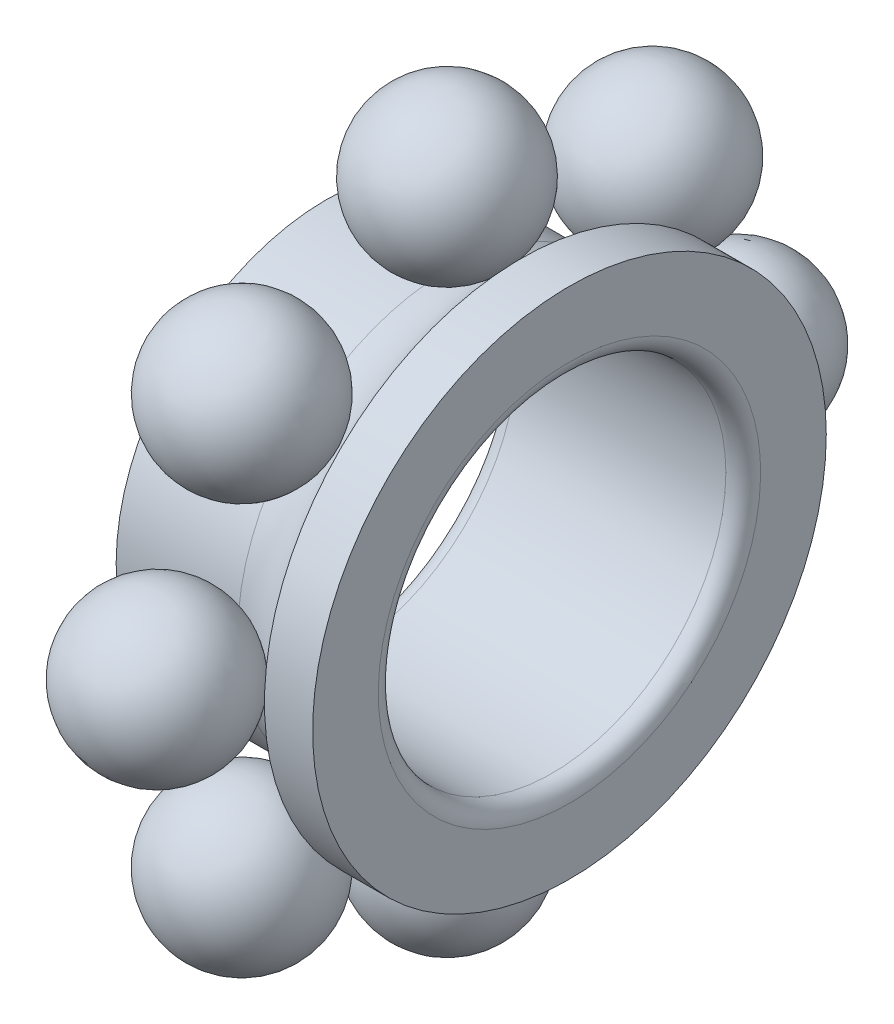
ISO-10303-21;
HEADER;
FILE_DESCRIPTION(('STEP AP214'),'2;1');
FILE_NAME('part.step','',(''),(''),'','','');
FILE_SCHEMA(('AUTOMOTIVE_DESIGN { 1 0 10303 214 1 1 1 1 }'));
ENDSEC;
DATA;
#1=APPLICATION_CONTEXT('core data for automotive mechanical design processes');
#2=APPLICATION_PROTOCOL_DEFINITION('international standard','automotive_design',2000,#1);
#3=PRODUCT_CONTEXT('',#1,'mechanical');
#4=PRODUCT('Part','Part','',(#3));
#5=PRODUCT_RELATED_PRODUCT_CATEGORY('part','',(#4));
#6=PRODUCT_DEFINITION_FORMATION('','',#4);
#7=PRODUCT_DEFINITION_CONTEXT('part definition',#1,'design');
#8=PRODUCT_DEFINITION('design','',#6,#7);
#9=PRODUCT_DEFINITION_SHAPE('','',#8);
#10=(LENGTH_UNIT() NAMED_UNIT(*) SI_UNIT(.MILLI.,.METRE.));
#11=(NAMED_UNIT(*) PLANE_ANGLE_UNIT() SI_UNIT($,.RADIAN.));
#12=(NAMED_UNIT(*) SI_UNIT($,.STERADIAN.) SOLID_ANGLE_UNIT());
#13=UNCERTAINTY_MEASURE_WITH_UNIT(LENGTH_MEASURE(1.E-05),#10,'distance_accuracy_value','');
#14=(GEOMETRIC_REPRESENTATION_CONTEXT(3) GLOBAL_UNCERTAINTY_ASSIGNED_CONTEXT((#13)) GLOBAL_UNIT_ASSIGNED_CONTEXT((#10,
#11,#12)) REPRESENTATION_CONTEXT('',''));
#15=CARTESIAN_POINT('',(0.,0.,0.));
#16=DIRECTION('',(0.,0.,1.));
#17=DIRECTION('',(1.,0.,0.));
#18=AXIS2_PLACEMENT_3D('',#15,#16,#17);
#19=CARTESIAN_POINT('',(6.95390666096,-16.7004378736,0.));
#20=DIRECTION('',(0.,0.877582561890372,-0.479425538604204));
#21=DIRECTION('',(0.,-0.479425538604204,-0.877582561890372));
#22=AXIS2_PLACEMENT_3D('',#19,#20,#21);
#23=SPHERICAL_SURFACE('',#22,4.5);
#24=CARTESIAN_POINT('',(6.95390666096,-12.7513163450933,-2.15741492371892));
#25=VERTEX_POINT('',#24);
#26=VERTEX_LOOP('',#25);
#27=FACE_BOUND('',#26,.T.);
#28=CARTESIAN_POINT('',(6.95390666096,-20.6495594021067,2.15741492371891));
#29=CARTESIAN_POINT('',(6.88027550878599,-20.6495607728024,2.15741567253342));
#30=CARTESIAN_POINT('',(6.80664448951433,-20.6479735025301,2.15654854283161));
#31=CARTESIAN_POINT('',(6.65955976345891,-20.6416315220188,2.15308390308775));
#32=CARTESIAN_POINT('',(6.58610605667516,-20.6368768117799,2.1504863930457));
#33=CARTESIAN_POINT('',(6.4395530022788,-20.6242097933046,2.14356636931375));
#34=CARTESIAN_POINT('',(6.36645365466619,-20.6162974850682,2.13924385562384));
#35=CARTESIAN_POINT('',(6.22078539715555,-20.5973347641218,2.12888447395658));
#36=CARTESIAN_POINT('',(6.14821648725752,-20.5862843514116,2.12284760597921));
#37=CARTESIAN_POINT('',(6.00378393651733,-20.5610719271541,2.10907399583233));
#38=CARTESIAN_POINT('',(5.93192029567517,-20.5469099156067,2.10133725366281));
#39=CARTESIAN_POINT('',(5.78907140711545,-20.515508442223,2.08418255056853));
#40=CARTESIAN_POINT('',(5.71808615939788,-20.4982689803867,2.07476458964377));
#41=CARTESIAN_POINT('',(5.57716506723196,-20.4607541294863,2.05427013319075));
#42=CARTESIAN_POINT('',(5.50722922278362,-20.4404787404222,2.04319363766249));
#43=CARTESIAN_POINT('',(5.3685754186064,-20.3969408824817,2.01940879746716));
#44=CARTESIAN_POINT('',(5.29985745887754,-20.3736784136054,2.00670045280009));
#45=CARTESIAN_POINT('',(5.16380497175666,-20.3242224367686,1.97968252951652));
#46=CARTESIAN_POINT('',(5.09647044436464,-20.2980289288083,1.96537295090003));
#47=CARTESIAN_POINT('',(4.96334703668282,-20.2427739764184,1.93518703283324));
#48=CARTESIAN_POINT('',(4.897558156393,-20.2137125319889,1.91931069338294));
#49=CARTESIAN_POINT('',(4.76768453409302,-20.152791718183,1.88602950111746));
#50=CARTESIAN_POINT('',(4.70359979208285,-20.1209323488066,1.86862464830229));
#51=CARTESIAN_POINT('',(4.57728883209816,-20.0544924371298,1.83232835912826));
#52=CARTESIAN_POINT('',(4.51506261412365,-20.0199118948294,1.8134369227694));
#53=CARTESIAN_POINT('',(4.39261861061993,-19.9481129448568,1.7742129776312));
#54=CARTESIAN_POINT('',(4.33240082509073,-19.9108945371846,1.75388046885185));
#55=CARTESIAN_POINT('',(4.21411875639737,-19.8339095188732,1.7118233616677));
#56=CARTESIAN_POINT('',(4.15605447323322,-19.7941429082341,1.6900987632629));
#57=CARTESIAN_POINT('',(4.04221929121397,-19.7121572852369,1.6453098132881));
#58=CARTESIAN_POINT('',(3.98644839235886,-19.6699382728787,1.62224546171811));
#59=CARTESIAN_POINT('',(3.87733433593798,-19.5831495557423,1.57483256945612));
#60=CARTESIAN_POINT('',(3.8239911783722,-19.538579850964,1.55048402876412));
#61=CARTESIAN_POINT('',(3.71986111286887,-19.4471971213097,1.5005614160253));
#62=CARTESIAN_POINT('',(3.66907420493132,-19.4003840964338,1.47498734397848));
#63=CARTESIAN_POINT('',(3.57017898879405,-19.3046275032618,1.42267527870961));
#64=CARTESIAN_POINT('',(3.52207068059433,-19.2556839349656,1.39593728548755));
#65=CARTESIAN_POINT('',(3.42864856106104,-19.1557841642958,1.34136179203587));
#66=CARTESIAN_POINT('',(3.38333474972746,-19.1048279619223,1.31352429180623));
#67=CARTESIAN_POINT('',(3.29561078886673,-19.0010256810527,1.2568168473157));
#68=CARTESIAN_POINT('',(3.25320063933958,-18.9481796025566,1.22794690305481));
#69=CARTESIAN_POINT('',(3.17138617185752,-18.8407248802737,1.16924412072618));
#70=CARTESIAN_POINT('',(3.13198185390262,-18.7861162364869,1.13941128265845));
#71=CARTESIAN_POINT('',(3.05627397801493,-18.6752679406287,1.07885458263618));
#72=CARTESIAN_POINT('',(3.01997042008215,-18.6190282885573,1.04813072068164));
#73=CARTESIAN_POINT('',(2.95055152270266,-18.5050534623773,0.985865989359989));
#74=CARTESIAN_POINT('',(2.91743618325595,-18.4473182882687,0.954325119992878));
#75=CARTESIAN_POINT('',(2.85447350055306,-18.3304915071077,0.890502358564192));
#76=CARTESIAN_POINT('',(2.82462615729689,-18.2713999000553,0.858220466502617));
#77=CARTESIAN_POINT('',(2.76827137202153,-18.1520026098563,0.792993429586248));
#78=CARTESIAN_POINT('',(2.74176393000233,-18.0916969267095,0.760048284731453));
#79=CARTESIAN_POINT('',(2.69215280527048,-17.9700167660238,0.693574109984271));
#80=CARTESIAN_POINT('',(2.66904912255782,-17.9086422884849,0.660045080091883));
#81=CARTESIAN_POINT('',(2.6263011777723,-17.7849723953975,0.592483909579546));
#82=CARTESIAN_POINT('',(2.60665691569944,-17.7226769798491,0.558451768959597));
#83=CARTESIAN_POINT('',(2.57087512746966,-17.5973152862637,0.489966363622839));
#84=CARTESIAN_POINT('',(2.55473760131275,-17.5342490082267,0.455513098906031));
#85=CARTESIAN_POINT('',(2.52600819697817,-17.4074975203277,0.386268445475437));
#86=CARTESIAN_POINT('',(2.51341631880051,-17.3438123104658,0.351477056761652));
#87=CARTESIAN_POINT('',(2.49180841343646,-17.2159763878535,0.281639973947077));
#88=CARTESIAN_POINT('',(2.48279238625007,-17.1518256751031,0.246594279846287));
#89=CARTESIAN_POINT('',(2.46835839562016,-17.0232132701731,0.176333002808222));
#90=CARTESIAN_POINT('',(2.46294043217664,-16.9587515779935,0.141117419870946));
#91=CARTESIAN_POINT('',(2.45571378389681,-16.8296725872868,0.0706012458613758));
#92=CARTESIAN_POINT('',(2.45390509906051,-16.7650552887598,0.035300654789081));
#93=CARTESIAN_POINT('',(2.45390666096,-16.7004378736,0.));
#94=B_SPLINE_CURVE_WITH_KNOTS('',3,(#28,#29,#30,#31,#32,#33,#34,#35,#36,#37,#38,#39,#40,#41,#42,
#43,#44,#45,#46,#47,#48,#49,#50,#51,#52,#53,#54,#55,#56,#57,#58,#59,#60,#61,#62,#63,#64,#65,#66,
#67,#68,#69,#70,#71,#72,#73,#74,#75,#76,#77,#78,#79,#80,#81,#82,#83,#84,#85,#86,#87,#88,#89,#90,
#91,#92,#93),.UNSPECIFIED.,.F.,.F.,(4,2,2,2,2,2,2,2,2,2,2,2,2,2,2,2,2,2,2,2,2,2,2,2,2,2,2,2,2,2,
2,2,4),(0.,0.220871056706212,0.441742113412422,0.662613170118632,0.883484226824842,
1.10435528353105,1.32522634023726,1.54609739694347,1.76696845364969,1.9878395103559,
2.20871056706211,2.42958162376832,2.65045268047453,2.87132373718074,3.09219479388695,
3.31306585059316,3.53393690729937,3.75480796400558,3.97567902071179,4.196550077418,
4.41742113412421,4.63829219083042,4.85916324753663,5.08003430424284,5.30090536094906,
5.52177641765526,5.74264747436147,5.96351853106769,6.1843895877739,6.40526064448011,
6.62613170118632,6.84700275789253,7.06787381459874),.UNSPECIFIED.);
#95=CARTESIAN_POINT('',(6.95390666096,-20.6495594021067,2.15741492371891));
#96=VERTEX_POINT('',#95);
#97=CARTESIAN_POINT('',(2.45390666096,-16.7004378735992,1.45022882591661E-12));
#98=VERTEX_POINT('',#97);
#99=EDGE_CURVE('P0_E11',#96,#98,#94,.T.);
#100=ORIENTED_EDGE('',*,*,#99,.T.);
#101=ORIENTED_EDGE('',*,*,#99,.F.);
#102=EDGE_LOOP('',(#100,#101));
#103=FACE_BOUND('',#102,.T.);
#104=ADVANCED_FACE('P0_F17',(#27,#103),#23,.T.);
#105=CLOSED_SHELL('',(#104));
#106=MANIFOLD_SOLID_BREP('P0_B1',#105);
#107=CARTESIAN_POINT('',(7.,0.,0.));
#108=DIRECTION('',(1.,0.,0.));
#109=DIRECTION('',(0.,0.877582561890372,0.479425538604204));
#110=AXIS2_PLACEMENT_3D('',#107,#108,#109);
#111=TOROIDAL_SURFACE('',#110,16.75,4.66666666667);
#112=CARTESIAN_POINT('',(7.,0.,0.));
#113=DIRECTION('',(1.,0.,0.));
#114=DIRECTION('',(0.,0.,-1.));
#115=AXIS2_PLACEMENT_3D('',#112,#113,#114);
#116=CIRCLE('',#115,12.0833333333);
#117=CARTESIAN_POINT('',(7.,0.,-12.0833333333));
#118=VERTEX_POINT('',#117);
#119=EDGE_CURVE('P1_E139',#118,#118,#116,.F.);
#120=ORIENTED_EDGE('',*,*,#119,.F.);
#121=EDGE_LOOP('',(#120));
#122=FACE_BOUND('',#121,.T.);
#123=CARTESIAN_POINT('',(11.2294363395,0.,0.));
#124=DIRECTION('',(1.,0.,0.));
#125=DIRECTION('',(0.,0.,-1.));
#126=AXIS2_PLACEMENT_3D('',#123,#124,#125);
#127=CIRCLE('',#126,14.7777814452);
#128=CARTESIAN_POINT('',(11.2294363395,0.,-14.7777814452));
#129=VERTEX_POINT('',#128);
#130=EDGE_CURVE('P1_E136',#129,#129,#127,.T.);
#131=ORIENTED_EDGE('',*,*,#130,.F.);
#132=EDGE_LOOP('',(#131));
#133=FACE_BOUND('',#132,.T.);
#134=ADVANCED_FACE('P1_F17',(#122,#133),#111,.F.);
#135=CARTESIAN_POINT('',(7.,0.,0.));
#136=DIRECTION('',(1.,0.,0.));
#137=DIRECTION('',(0.,0.,-1.));
#138=AXIS2_PLACEMENT_3D('',#135,#136,#137);
#139=CYLINDRICAL_SURFACE('',#138,14.7777814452);
#140=ORIENTED_EDGE('',*,*,#130,.T.);
#141=EDGE_LOOP('',(#140));
#142=FACE_BOUND('',#141,.T.);
#143=CARTESIAN_POINT('',(14.,0.,0.));
#144=DIRECTION('',(1.,0.,0.));
#145=DIRECTION('',(0.,0.,-1.));
#146=AXIS2_PLACEMENT_3D('',#143,#144,#145);
#147=CIRCLE('',#146,14.7777814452);
#148=CARTESIAN_POINT('',(14.,0.,-14.7777814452));
#149=VERTEX_POINT('',#148);
#150=EDGE_CURVE('P1_E61',#149,#149,#147,.T.);
#151=ORIENTED_EDGE('',*,*,#150,.F.);
#152=EDGE_LOOP('',(#151));
#153=FACE_BOUND('',#152,.T.);
#154=ADVANCED_FACE('P1_F186',(#142,#153),#139,.T.);
#155=CARTESIAN_POINT('',(7.,0.,0.));
#156=DIRECTION('',(1.,0.,0.));
#157=DIRECTION('',(0.,0.,-1.));
#158=AXIS2_PLACEMENT_3D('',#155,#156,#157);
#159=CYLINDRICAL_SURFACE('',#158,12.0833333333);
#160=CARTESIAN_POINT('',(0.,0.,0.));
#161=DIRECTION('',(1.,0.,0.));
#162=DIRECTION('',(0.,0.,-1.));
#163=AXIS2_PLACEMENT_3D('',#160,#161,#162);
#164=CIRCLE('',#163,12.0833333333);
#165=CARTESIAN_POINT('',(0.,0.,-12.0833333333));
#166=VERTEX_POINT('',#165);
#167=EDGE_CURVE('P1_E60',#166,#166,#164,.T.);
#168=ORIENTED_EDGE('',*,*,#167,.T.);
#169=EDGE_LOOP('',(#168));
#170=FACE_BOUND('',#169,.T.);
#171=ORIENTED_EDGE('',*,*,#119,.T.);
#172=EDGE_LOOP('',(#171));
#173=FACE_BOUND('',#172,.T.);
#174=ADVANCED_FACE('P1_F79',(#170,#173),#159,.T.);
#175=CARTESIAN_POINT('',(14.,11.,0.));
#176=DIRECTION('',(1.,0.,0.));
#177=DIRECTION('',(0.,0.,-1.));
#178=AXIS2_PLACEMENT_3D('',#175,#176,#177);
#179=PLANE('',#178);
#180=CARTESIAN_POINT('',(14.,0.,0.));
#181=DIRECTION('',(1.,0.,0.));
#182=DIRECTION('',(0.,0.877582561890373,0.479425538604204));
#183=AXIS2_PLACEMENT_3D('',#180,#181,#182);
#184=CIRCLE('',#183,10.9999999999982);
#185=CARTESIAN_POINT('',(14.,9.65340818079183,5.2736809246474));
#186=VERTEX_POINT('',#185);
#187=CARTESIAN_POINT('',(14.,-9.65340818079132,-5.27368092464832));
#188=VERTEX_POINT('',#187);
#189=EDGE_CURVE('P1_E45',#186,#188,#184,.T.);
#190=ORIENTED_EDGE('',*,*,#189,.F.);
#191=CARTESIAN_POINT('',(14.,0.,0.));
#192=DIRECTION('',(1.,0.,0.));
#193=DIRECTION('',(0.,-0.877582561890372,-0.479425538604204));
#194=AXIS2_PLACEMENT_3D('',#191,#192,#193);
#195=CIRCLE('',#194,10.9999999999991);
#196=EDGE_CURVE('P1_E48',#188,#186,#195,.T.);
#197=ORIENTED_EDGE('',*,*,#196,.F.);
#198=EDGE_LOOP('',(#190,#197));
#199=FACE_BOUND('',#198,.T.);
#200=ORIENTED_EDGE('',*,*,#150,.T.);
#201=EDGE_LOOP('',(#200));
#202=FACE_BOUND('',#201,.T.);
#203=ADVANCED_FACE('P1_F58',(#199,#202),#179,.T.);
#204=CARTESIAN_POINT('',(0.,12.0833333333,0.));
#205=DIRECTION('',(1.,0.,0.));
#206=DIRECTION('',(0.,0.,-1.));
#207=AXIS2_PLACEMENT_3D('',#204,#205,#206);
#208=PLANE('',#207);
#209=CARTESIAN_POINT('',(0.,0.,0.));
#210=DIRECTION('',(-1.,0.,0.));
#211=DIRECTION('',(0.,-0.877582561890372,-0.479425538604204));
#212=AXIS2_PLACEMENT_3D('',#209,#210,#211);
#213=CIRCLE('',#212,10.9999999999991);
#214=CARTESIAN_POINT('',(0.,-9.65340818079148,-5.27368092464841));
#215=VERTEX_POINT('',#214);
#216=CARTESIAN_POINT('',(0.,9.65340818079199,5.27368092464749));
#217=VERTEX_POINT('',#216);
#218=EDGE_CURVE('P1_E36',#215,#217,#213,.T.);
#219=ORIENTED_EDGE('',*,*,#218,.F.);
#220=CARTESIAN_POINT('',(0.,0.,0.));
#221=DIRECTION('',(-1.,0.,0.));
#222=DIRECTION('',(0.,0.877582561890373,0.479425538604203));
#223=AXIS2_PLACEMENT_3D('',#220,#221,#222);
#224=CIRCLE('',#223,10.9999999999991);
#225=EDGE_CURVE('P1_E54',#217,#215,#224,.T.);
#226=ORIENTED_EDGE('',*,*,#225,.F.);
#227=EDGE_LOOP('',(#219,#226));
#228=FACE_BOUND('',#227,.T.);
#229=ORIENTED_EDGE('',*,*,#167,.F.);
#230=EDGE_LOOP('',(#229));
#231=FACE_BOUND('',#230,.T.);
#232=ADVANCED_FACE('P1_F78',(#228,#231),#208,.F.);
#233=CARTESIAN_POINT('',(13.,0.,0.));
#234=DIRECTION('',(1.,0.,0.));
#235=DIRECTION('',(0.,0.877582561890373,0.479425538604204));
#236=AXIS2_PLACEMENT_3D('',#233,#234,#235);
#237=TOROIDAL_SURFACE('',#236,11.,1.);
#238=ORIENTED_EDGE('',*,*,#189,.T.);
#239=ORIENTED_EDGE('',*,*,#196,.T.);
#240=EDGE_LOOP('',(#238,#239));
#241=FACE_BOUND('',#240,.T.);
#242=CARTESIAN_POINT('',(13.,0.,0.));
#243=DIRECTION('',(1.,0.,0.));
#244=DIRECTION('',(0.,0.,-1.));
#245=AXIS2_PLACEMENT_3D('',#242,#243,#244);
#246=CIRCLE('',#245,10.);
#247=CARTESIAN_POINT('',(13.,0.,-10.));
#248=VERTEX_POINT('',#247);
#249=EDGE_CURVE('P1_E28',#248,#248,#246,.F.);
#250=ORIENTED_EDGE('',*,*,#249,.T.);
#251=EDGE_LOOP('',(#250));
#252=FACE_BOUND('',#251,.T.);
#253=ADVANCED_FACE('P1_F50',(#241,#252),#237,.T.);
#254=CARTESIAN_POINT('',(1.,0.,0.));
#255=DIRECTION('',(1.,0.,0.));
#256=DIRECTION('',(0.,0.877582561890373,0.479425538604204));
#257=AXIS2_PLACEMENT_3D('',#254,#255,#256);
#258=TOROIDAL_SURFACE('',#257,11.,1.);
#259=CARTESIAN_POINT('',(1.,0.,0.));
#260=DIRECTION('',(1.,0.,0.));
#261=DIRECTION('',(0.,0.,-1.));
#262=AXIS2_PLACEMENT_3D('',#259,#260,#261);
#263=CIRCLE('',#262,10.);
#264=CARTESIAN_POINT('',(1.,0.,-10.));
#265=VERTEX_POINT('',#264);
#266=EDGE_CURVE('P1_E11',#265,#265,#263,.T.);
#267=ORIENTED_EDGE('',*,*,#266,.T.);
#268=EDGE_LOOP('',(#267));
#269=FACE_BOUND('',#268,.T.);
#270=ORIENTED_EDGE('',*,*,#218,.T.);
#271=ORIENTED_EDGE('',*,*,#225,.T.);
#272=EDGE_LOOP('',(#270,#271));
#273=FACE_BOUND('',#272,.T.);
#274=ADVANCED_FACE('P1_F115',(#269,#273),#258,.T.);
#275=CARTESIAN_POINT('',(7.,0.,0.));
#276=DIRECTION('',(1.,0.,0.));
#277=DIRECTION('',(0.,0.,-1.));
#278=AXIS2_PLACEMENT_3D('',#275,#276,#277);
#279=CYLINDRICAL_SURFACE('',#278,10.);
#280=ORIENTED_EDGE('',*,*,#249,.F.);
#281=EDGE_LOOP('',(#280));
#282=FACE_BOUND('',#281,.T.);
#283=ORIENTED_EDGE('',*,*,#266,.F.);
#284=EDGE_LOOP('',(#283));
#285=FACE_BOUND('',#284,.T.);
#286=ADVANCED_FACE('P1_F19',(#282,#285),#279,.F.);
#287=CLOSED_SHELL('',(#134,#154,#174,#203,#232,#253,#274,#286));
#288=MANIFOLD_SOLID_BREP('P1_B1',#287);
#289=CARTESIAN_POINT('',(6.95390666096,11.8089928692,-11.8089928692));
#290=DIRECTION('',(0.,-0.28153953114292,0.959549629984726));
#291=DIRECTION('',(0.,0.959549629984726,0.28153953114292));
#292=AXIS2_PLACEMENT_3D('',#289,#290,#291);
#293=SPHERICAL_SURFACE('',#292,4.5);
#294=CARTESIAN_POINT('',(6.95390666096,10.5420649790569,-7.49101953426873));
#295=VERTEX_POINT('',#294);
#296=VERTEX_LOOP('',#295);
#297=FACE_BOUND('',#296,.T.);
#298=CARTESIAN_POINT('',(6.95390666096,13.0759207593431,-16.1269662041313));
#299=CARTESIAN_POINT('',(6.88027550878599,13.0759211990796,-16.1269677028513));
#300=CARTESIAN_POINT('',(6.80664448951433,13.0754119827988,-16.1252321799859));
#301=CARTESIAN_POINT('',(6.65955976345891,13.0733773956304,-16.118297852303));
#302=CARTESIAN_POINT('',(6.58610605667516,13.0718520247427,-16.1130990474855));
#303=CARTESIAN_POINT('',(6.4395530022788,13.0677882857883,-16.0992489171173));
#304=CARTESIAN_POINT('',(6.36645365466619,13.0652499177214,-16.0905975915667));
#305=CARTESIAN_POINT('',(6.22078539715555,13.0591664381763,-16.0698637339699));
#306=CARTESIAN_POINT('',(6.14821648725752,13.0556213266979,-16.0577812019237));
#307=CARTESIAN_POINT('',(6.00378393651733,13.0475328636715,-16.0302139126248));
#308=CARTESIAN_POINT('',(5.93192029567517,13.0429895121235,-16.014729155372));
#309=CARTESIAN_POINT('',(5.78907140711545,13.0329155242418,-15.980394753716));
#310=CARTESIAN_POINT('',(5.71808615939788,13.0273848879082,-15.9615451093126));
#311=CARTESIAN_POINT('',(5.57716506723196,13.015349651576,-15.9205263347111));
#312=CARTESIAN_POINT('',(5.50722922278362,13.0088450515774,-15.8983572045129));
#313=CARTESIAN_POINT('',(5.3685754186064,12.9948775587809,-15.8507528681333));
#314=CARTESIAN_POINT('',(5.29985745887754,12.987414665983,-15.8253176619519));
#315=CARTESIAN_POINT('',(5.16380497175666,12.9715485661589,-15.7712424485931));
#316=CARTESIAN_POINT('',(5.09647044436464,12.9631453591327,-15.7426024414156));
#317=CARTESIAN_POINT('',(4.96334703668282,12.945418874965,-15.6821866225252));
#318=CARTESIAN_POINT('',(4.897558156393,12.9360955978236,-15.6504108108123));
#319=CARTESIAN_POINT('',(4.76768453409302,12.9165514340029,-15.5837999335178));
#320=CARTESIAN_POINT('',(4.70359979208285,12.9063305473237,-15.5489648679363));
#321=CARTESIAN_POINT('',(4.57728883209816,12.8850157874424,-15.4763194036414));
#322=CARTESIAN_POINT('',(4.51506261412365,12.8739219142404,-15.4385090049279));
#323=CARTESIAN_POINT('',(4.39261861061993,12.8508879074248,-15.3600039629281));
#324=CARTESIAN_POINT('',(4.33240082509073,12.8389477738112,-15.3193093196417));
#325=CARTESIAN_POINT('',(4.21411875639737,12.8142500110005,-15.235133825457));
#326=CARTESIAN_POINT('',(4.15605447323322,12.8014923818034,-15.1916529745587));
#327=CARTESIAN_POINT('',(4.04221929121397,12.7751903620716,-15.1020098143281));
#328=CARTESIAN_POINT('',(3.98644839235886,12.7616459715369,-15.0558475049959));
#329=CARTESIAN_POINT('',(3.87733433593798,12.7338030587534,-14.9609526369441));
#330=CARTESIAN_POINT('',(3.8239911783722,12.7195045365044,-14.9122200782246));
#331=CARTESIAN_POINT('',(3.71986111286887,12.6901878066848,-14.8123021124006));
#332=CARTESIAN_POINT('',(3.66907420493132,12.675169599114,-14.7611167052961));
#333=CARTESIAN_POINT('',(3.57017898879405,12.6444496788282,-14.6564163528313));
#334=CARTESIAN_POINT('',(3.52207068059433,12.6287479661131,-14.602901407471));
#335=CARTESIAN_POINT('',(3.42864856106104,12.5966988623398,-14.4936709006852));
#336=CARTESIAN_POINT('',(3.38333474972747,12.5803514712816,-14.4379553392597));
#337=CARTESIAN_POINT('',(3.29561078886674,12.5470503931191,-14.3244578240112));
#338=CARTESIAN_POINT('',(3.25320063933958,12.5300967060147,-14.2666758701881));
#339=CARTESIAN_POINT('',(3.17138617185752,12.495623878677,-14.1491847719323));
#340=CARTESIAN_POINT('',(3.13198185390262,12.4781047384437,-14.0894756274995));
#341=CARTESIAN_POINT('',(3.05627397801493,12.4425432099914,-13.9682739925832));
#342=CARTESIAN_POINT('',(3.01997042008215,12.4245008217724,-13.9067815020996));
#343=CARTESIAN_POINT('',(2.95055152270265,12.3879362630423,-13.7821613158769));
#344=CARTESIAN_POINT('',(2.91743618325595,12.3694140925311,-13.7190336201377));
#345=CARTESIAN_POINT('',(2.85447350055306,12.3319345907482,-13.5912951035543));
#346=CARTESIAN_POINT('',(2.82462615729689,12.3129772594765,-13.5266842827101));
#347=CARTESIAN_POINT('',(2.76827137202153,12.2746731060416,-13.3961351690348));
#348=CARTESIAN_POINT('',(2.74176393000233,12.2553262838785,-13.3301968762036));
#349=CARTESIAN_POINT('',(2.69215280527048,12.2162897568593,-13.1971516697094));
#350=CARTESIAN_POINT('',(2.66904912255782,12.1966000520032,-13.1300447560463));
#351=CARTESIAN_POINT('',(2.6263011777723,12.1569251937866,-12.9948239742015));
#352=CARTESIAN_POINT('',(2.60665691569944,12.1369400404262,-12.9267101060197));
#353=CARTESIAN_POINT('',(2.57087512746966,12.0967224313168,-12.7896395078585));
#354=CARTESIAN_POINT('',(2.55473760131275,12.0764899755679,-12.720682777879));
#355=CARTESIAN_POINT('',(2.52600819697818,12.0358265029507,-12.5820925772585));
#356=CARTESIAN_POINT('',(2.51341631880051,12.0153954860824,-12.5124591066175));
#357=CARTESIAN_POINT('',(2.49180841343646,11.9743841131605,-12.3726831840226));
#358=CARTESIAN_POINT('',(2.48279238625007,11.9538037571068,-12.3025407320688));
#359=CARTESIAN_POINT('',(2.46835839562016,11.9125432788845,-12.1619158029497));
#360=CARTESIAN_POINT('',(2.46294043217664,11.8918631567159,-12.0914333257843));
#361=CARTESIAN_POINT('',(2.45571378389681,11.8504529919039,-11.9502982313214));
#362=CARTESIAN_POINT('',(2.45390509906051,11.8297229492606,-11.8796456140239));
#363=CARTESIAN_POINT('',(2.45390666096,11.8089928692,-11.8089928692));
#364=B_SPLINE_CURVE_WITH_KNOTS('',3,(#298,#299,#300,#301,#302,#303,#304,#305,#306,#307,#308,
#309,#310,#311,#312,#313,#314,#315,#316,#317,#318,#319,#320,#321,#322,#323,#324,#325,#326,#327,
#328,#329,#330,#331,#332,#333,#334,#335,#336,#337,#338,#339,#340,#341,#342,#343,#344,#345,#346,
#347,#348,#349,#350,#351,#352,#353,#354,#355,#356,#357,#358,#359,#360,#361,#362,#363),
.UNSPECIFIED.,.F.,.F.,(4,2,2,2,2,2,2,2,2,2,2,2,2,2,2,2,2,2,2,2,2,2,2,2,2,2,2,2,2,2,2,2,4),(0.,
0.220871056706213,0.441742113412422,0.662613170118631,0.883484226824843,1.10435528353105,
1.32522634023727,1.54609739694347,1.76696845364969,1.9878395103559,2.20871056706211,
2.42958162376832,2.65045268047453,2.87132373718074,3.09219479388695,3.31306585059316,
3.53393690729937,3.75480796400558,3.97567902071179,4.196550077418,4.41742113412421,
4.63829219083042,4.85916324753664,5.08003430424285,5.30090536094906,5.52177641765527,
5.74264747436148,5.96351853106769,6.1843895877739,6.40526064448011,6.62613170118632,
6.84700275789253,7.06787381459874),.UNSPECIFIED.);
#365=CARTESIAN_POINT('',(6.95390666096,13.0759207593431,-16.1269662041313));
#366=VERTEX_POINT('',#365);
#367=CARTESIAN_POINT('',(2.45390666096,11.808992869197,-11.8089928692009));
#368=VERTEX_POINT('',#367);
#369=EDGE_CURVE('P2_E11',#366,#368,#364,.T.);
#370=ORIENTED_EDGE('',*,*,#369,.T.);
#371=ORIENTED_EDGE('',*,*,#369,.F.);
#372=EDGE_LOOP('',(#370,#371));
#373=FACE_BOUND('',#372,.T.);
#374=ADVANCED_FACE('P2_F17',(#297,#373),#293,.T.);
#375=CLOSED_SHELL('',(#374));
#376=MANIFOLD_SOLID_BREP('P2_B1',#375);
#377=CARTESIAN_POINT('',(6.95390666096,0.,16.7004378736));
#378=DIRECTION('',(0.,-0.479425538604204,-0.877582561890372));
#379=DIRECTION('',(0.,-0.877582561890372,0.479425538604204));
#380=AXIS2_PLACEMENT_3D('',#377,#378,#379);
#381=SPHERICAL_SURFACE('',#380,4.5);
#382=CARTESIAN_POINT('',(6.95390666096,-2.15741492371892,12.7513163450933));
#383=VERTEX_POINT('',#382);
#384=VERTEX_LOOP('',#383);
#385=FACE_BOUND('',#384,.T.);
#386=CARTESIAN_POINT('',(6.95390666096,2.15741492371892,20.6495594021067));
#387=CARTESIAN_POINT('',(6.88027550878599,2.15741567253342,20.6495607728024));
#388=CARTESIAN_POINT('',(6.80664448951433,2.15654854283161,20.6479735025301));
#389=CARTESIAN_POINT('',(6.65955976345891,2.15308390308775,20.6416315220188));
#390=CARTESIAN_POINT('',(6.58610605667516,2.15048639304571,20.6368768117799));
#391=CARTESIAN_POINT('',(6.4395530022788,2.14356636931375,20.6242097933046));
#392=CARTESIAN_POINT('',(6.36645365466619,2.13924385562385,20.6162974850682));
#393=CARTESIAN_POINT('',(6.22078539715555,2.12888447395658,20.5973347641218));
#394=CARTESIAN_POINT('',(6.14821648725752,2.12284760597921,20.5862843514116));
#395=CARTESIAN_POINT('',(6.00378393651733,2.10907399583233,20.5610719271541));
#396=CARTESIAN_POINT('',(5.93192029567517,2.10133725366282,20.5469099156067));
#397=CARTESIAN_POINT('',(5.78907140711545,2.08418255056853,20.515508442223));
#398=CARTESIAN_POINT('',(5.71808615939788,2.07476458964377,20.4982689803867));
#399=CARTESIAN_POINT('',(5.57716506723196,2.05427013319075,20.4607541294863));
#400=CARTESIAN_POINT('',(5.50722922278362,2.04319363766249,20.4404787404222));
#401=CARTESIAN_POINT('',(5.3685754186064,2.01940879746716,20.3969408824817));
#402=CARTESIAN_POINT('',(5.29985745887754,2.00670045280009,20.3736784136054));
#403=CARTESIAN_POINT('',(5.16380497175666,1.97968252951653,20.3242224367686));
#404=CARTESIAN_POINT('',(5.09647044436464,1.96537295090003,20.2980289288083));
#405=CARTESIAN_POINT('',(4.96334703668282,1.93518703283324,20.2427739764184));
#406=CARTESIAN_POINT('',(4.897558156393,1.91931069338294,20.2137125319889));
#407=CARTESIAN_POINT('',(4.76768453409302,1.88602950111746,20.152791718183));
#408=CARTESIAN_POINT('',(4.70359979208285,1.86862464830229,20.1209323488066));
#409=CARTESIAN_POINT('',(4.57728883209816,1.83232835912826,20.0544924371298));
#410=CARTESIAN_POINT('',(4.51506261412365,1.8134369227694,20.0199118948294));
#411=CARTESIAN_POINT('',(4.39261861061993,1.7742129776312,19.9481129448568));
#412=CARTESIAN_POINT('',(4.33240082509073,1.75388046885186,19.9108945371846));
#413=CARTESIAN_POINT('',(4.21411875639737,1.71182336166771,19.8339095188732));
#414=CARTESIAN_POINT('',(4.15605447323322,1.6900987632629,19.7941429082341));
#415=CARTESIAN_POINT('',(4.04221929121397,1.6453098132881,19.7121572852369));
#416=CARTESIAN_POINT('',(3.98644839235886,1.62224546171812,19.6699382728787));
#417=CARTESIAN_POINT('',(3.87733433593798,1.57483256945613,19.5831495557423));
#418=CARTESIAN_POINT('',(3.8239911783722,1.55048402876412,19.538579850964));
#419=CARTESIAN_POINT('',(3.71986111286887,1.5005614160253,19.4471971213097));
#420=CARTESIAN_POINT('',(3.66907420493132,1.47498734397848,19.4003840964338));
#421=CARTESIAN_POINT('',(3.57017898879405,1.42267527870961,19.3046275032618));
#422=CARTESIAN_POINT('',(3.52207068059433,1.39593728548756,19.2556839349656));
#423=CARTESIAN_POINT('',(3.42864856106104,1.34136179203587,19.1557841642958));
#424=CARTESIAN_POINT('',(3.38333474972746,1.31352429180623,19.1048279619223));
#425=CARTESIAN_POINT('',(3.29561078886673,1.2568168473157,19.0010256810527));
#426=CARTESIAN_POINT('',(3.25320063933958,1.22794690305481,18.9481796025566));
#427=CARTESIAN_POINT('',(3.17138617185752,1.16924412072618,18.8407248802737));
#428=CARTESIAN_POINT('',(3.13198185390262,1.13941128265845,18.7861162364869));
#429=CARTESIAN_POINT('',(3.05627397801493,1.07885458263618,18.6752679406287));
#430=CARTESIAN_POINT('',(3.01997042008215,1.04813072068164,18.6190282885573));
#431=CARTESIAN_POINT('',(2.95055152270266,0.98586598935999,18.5050534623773));
#432=CARTESIAN_POINT('',(2.91743618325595,0.954325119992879,18.4473182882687));
#433=CARTESIAN_POINT('',(2.85447350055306,0.890502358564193,18.3304915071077));
#434=CARTESIAN_POINT('',(2.82462615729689,0.858220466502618,18.2713999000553));
#435=CARTESIAN_POINT('',(2.76827137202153,0.792993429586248,18.1520026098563));
#436=CARTESIAN_POINT('',(2.74176393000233,0.760048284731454,18.0916969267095));
#437=CARTESIAN_POINT('',(2.69215280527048,0.693574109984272,17.9700167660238));
#438=CARTESIAN_POINT('',(2.66904912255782,0.660045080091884,17.9086422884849));
#439=CARTESIAN_POINT('',(2.6263011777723,0.592483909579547,17.7849723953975));
#440=CARTESIAN_POINT('',(2.60665691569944,0.558451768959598,17.7226769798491));
#441=CARTESIAN_POINT('',(2.57087512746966,0.48996636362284,17.5973152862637));
#442=CARTESIAN_POINT('',(2.55473760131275,0.455513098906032,17.5342490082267));
#443=CARTESIAN_POINT('',(2.52600819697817,0.386268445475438,17.4074975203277));
#444=CARTESIAN_POINT('',(2.51341631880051,0.351477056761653,17.3438123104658));
#445=CARTESIAN_POINT('',(2.49180841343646,0.281639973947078,17.2159763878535));
#446=CARTESIAN_POINT('',(2.48279238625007,0.246594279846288,17.1518256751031));
#447=CARTESIAN_POINT('',(2.46835839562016,0.176333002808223,17.0232132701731));
#448=CARTESIAN_POINT('',(2.46294043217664,0.141117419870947,16.9587515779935));
#449=CARTESIAN_POINT('',(2.45571378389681,0.0706012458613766,16.8296725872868));
#450=CARTESIAN_POINT('',(2.45390509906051,0.0353006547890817,16.7650552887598));
#451=CARTESIAN_POINT('',(2.45390666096,0.,16.7004378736));
#452=B_SPLINE_CURVE_WITH_KNOTS('',3,(#386,#387,#388,#389,#390,#391,#392,#393,#394,#395,#396,
#397,#398,#399,#400,#401,#402,#403,#404,#405,#406,#407,#408,#409,#410,#411,#412,#413,#414,#415,
#416,#417,#418,#419,#420,#421,#422,#423,#424,#425,#426,#427,#428,#429,#430,#431,#432,#433,#434,
#435,#436,#437,#438,#439,#440,#441,#442,#443,#444,#445,#446,#447,#448,#449,#450,#451),
.UNSPECIFIED.,.F.,.F.,(4,2,2,2,2,2,2,2,2,2,2,2,2,2,2,2,2,2,2,2,2,2,2,2,2,2,2,2,2,2,2,2,4),(0.,
0.220871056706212,0.441742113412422,0.662613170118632,0.883484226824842,1.10435528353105,
1.32522634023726,1.54609739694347,1.76696845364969,1.9878395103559,2.20871056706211,
2.42958162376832,2.65045268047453,2.87132373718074,3.09219479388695,3.31306585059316,
3.53393690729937,3.75480796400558,3.97567902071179,4.196550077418,4.41742113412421,
4.63829219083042,4.85916324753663,5.08003430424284,5.30090536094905,5.52177641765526,
5.74264747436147,5.96351853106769,6.1843895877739,6.4052606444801,6.62613170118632,
6.84700275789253,7.06787381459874),.UNSPECIFIED.);
#453=CARTESIAN_POINT('',(6.95390666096,2.15741492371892,20.6495594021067));
#454=VERTEX_POINT('',#453);
#455=CARTESIAN_POINT('',(2.45390666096,1.45239723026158E-12,16.7004378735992));
#456=VERTEX_POINT('',#455);
#457=EDGE_CURVE('P3_E11',#454,#456,#452,.T.);
#458=ORIENTED_EDGE('',*,*,#457,.T.);
#459=ORIENTED_EDGE('',*,*,#457,.F.);
#460=EDGE_LOOP('',(#458,#459));
#461=FACE_BOUND('',#460,.T.);
#462=ADVANCED_FACE('P3_F17',(#385,#461),#381,.T.);
#463=CLOSED_SHELL('',(#462));
#464=MANIFOLD_SOLID_BREP('P3_B1',#463);
#465=CARTESIAN_POINT('',(6.95390666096,-11.8089928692,11.8089928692));
#466=DIRECTION('',(0.,0.28153953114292,-0.959549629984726));
#467=DIRECTION('',(0.,-0.959549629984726,-0.28153953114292));
#468=AXIS2_PLACEMENT_3D('',#465,#466,#467);
#469=SPHERICAL_SURFACE('',#468,4.5);
#470=CARTESIAN_POINT('',(6.95390666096,-10.5420649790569,7.49101953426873));
#471=VERTEX_POINT('',#470);
#472=VERTEX_LOOP('',#471);
#473=FACE_BOUND('',#472,.T.);
#474=CARTESIAN_POINT('',(6.95390666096,-13.0759207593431,16.1269662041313));
#475=CARTESIAN_POINT('',(6.88027550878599,-13.0759211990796,16.1269677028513));
#476=CARTESIAN_POINT('',(6.80664448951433,-13.0754119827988,16.1252321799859));
#477=CARTESIAN_POINT('',(6.65955976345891,-13.0733773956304,16.118297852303));
#478=CARTESIAN_POINT('',(6.58610605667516,-13.0718520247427,16.1130990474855));
#479=CARTESIAN_POINT('',(6.4395530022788,-13.0677882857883,16.0992489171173));
#480=CARTESIAN_POINT('',(6.36645365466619,-13.0652499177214,16.0905975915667));
#481=CARTESIAN_POINT('',(6.22078539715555,-13.0591664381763,16.0698637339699));
#482=CARTESIAN_POINT('',(6.14821648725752,-13.0556213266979,16.0577812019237));
#483=CARTESIAN_POINT('',(6.00378393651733,-13.0475328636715,16.0302139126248));
#484=CARTESIAN_POINT('',(5.93192029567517,-13.0429895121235,16.014729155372));
#485=CARTESIAN_POINT('',(5.78907140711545,-13.0329155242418,15.980394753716));
#486=CARTESIAN_POINT('',(5.71808615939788,-13.0273848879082,15.9615451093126));
#487=CARTESIAN_POINT('',(5.57716506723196,-13.015349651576,15.9205263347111));
#488=CARTESIAN_POINT('',(5.50722922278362,-13.0088450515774,15.8983572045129));
#489=CARTESIAN_POINT('',(5.3685754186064,-12.9948775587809,15.8507528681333));
#490=CARTESIAN_POINT('',(5.29985745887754,-12.987414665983,15.8253176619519));
#491=CARTESIAN_POINT('',(5.16380497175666,-12.9715485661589,15.7712424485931));
#492=CARTESIAN_POINT('',(5.09647044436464,-12.9631453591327,15.7426024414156));
#493=CARTESIAN_POINT('',(4.96334703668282,-12.945418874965,15.6821866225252));
#494=CARTESIAN_POINT('',(4.897558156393,-12.9360955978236,15.6504108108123));
#495=CARTESIAN_POINT('',(4.76768453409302,-12.9165514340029,15.5837999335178));
#496=CARTESIAN_POINT('',(4.70359979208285,-12.9063305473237,15.5489648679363));
#497=CARTESIAN_POINT('',(4.57728883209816,-12.8850157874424,15.4763194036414));
#498=CARTESIAN_POINT('',(4.51506261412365,-12.8739219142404,15.4385090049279));
#499=CARTESIAN_POINT('',(4.39261861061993,-12.8508879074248,15.3600039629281));
#500=CARTESIAN_POINT('',(4.33240082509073,-12.8389477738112,15.3193093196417));
#501=CARTESIAN_POINT('',(4.21411875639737,-12.8142500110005,15.235133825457));
#502=CARTESIAN_POINT('',(4.15605447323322,-12.8014923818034,15.1916529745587));
#503=CARTESIAN_POINT('',(4.04221929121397,-12.7751903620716,15.1020098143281));
#504=CARTESIAN_POINT('',(3.98644839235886,-12.7616459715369,15.0558475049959));
#505=CARTESIAN_POINT('',(3.87733433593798,-12.7338030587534,14.9609526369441));
#506=CARTESIAN_POINT('',(3.8239911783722,-12.7195045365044,14.9122200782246));
#507=CARTESIAN_POINT('',(3.71986111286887,-12.6901878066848,14.8123021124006));
#508=CARTESIAN_POINT('',(3.66907420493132,-12.675169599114,14.7611167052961));
#509=CARTESIAN_POINT('',(3.57017898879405,-12.6444496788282,14.6564163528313));
#510=CARTESIAN_POINT('',(3.52207068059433,-12.6287479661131,14.602901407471));
#511=CARTESIAN_POINT('',(3.42864856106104,-12.5966988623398,14.4936709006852));
#512=CARTESIAN_POINT('',(3.38333474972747,-12.5803514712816,14.4379553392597));
#513=CARTESIAN_POINT('',(3.29561078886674,-12.5470503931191,14.3244578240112));
#514=CARTESIAN_POINT('',(3.25320063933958,-12.5300967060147,14.2666758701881));
#515=CARTESIAN_POINT('',(3.17138617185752,-12.495623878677,14.1491847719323));
#516=CARTESIAN_POINT('',(3.13198185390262,-12.4781047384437,14.0894756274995));
#517=CARTESIAN_POINT('',(3.05627397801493,-12.4425432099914,13.9682739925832));
#518=CARTESIAN_POINT('',(3.01997042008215,-12.4245008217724,13.9067815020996));
#519=CARTESIAN_POINT('',(2.95055152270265,-12.3879362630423,13.7821613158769));
#520=CARTESIAN_POINT('',(2.91743618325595,-12.3694140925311,13.7190336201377));
#521=CARTESIAN_POINT('',(2.85447350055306,-12.3319345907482,13.5912951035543));
#522=CARTESIAN_POINT('',(2.82462615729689,-12.3129772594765,13.5266842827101));
#523=CARTESIAN_POINT('',(2.76827137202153,-12.2746731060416,13.3961351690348));
#524=CARTESIAN_POINT('',(2.74176393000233,-12.2553262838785,13.3301968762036));
#525=CARTESIAN_POINT('',(2.69215280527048,-12.2162897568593,13.1971516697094));
#526=CARTESIAN_POINT('',(2.66904912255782,-12.1966000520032,13.1300447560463));
#527=CARTESIAN_POINT('',(2.6263011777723,-12.1569251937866,12.9948239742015));
#528=CARTESIAN_POINT('',(2.60665691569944,-12.1369400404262,12.9267101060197));
#529=CARTESIAN_POINT('',(2.57087512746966,-12.0967224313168,12.7896395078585));
#530=CARTESIAN_POINT('',(2.55473760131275,-12.0764899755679,12.720682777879));
#531=CARTESIAN_POINT('',(2.52600819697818,-12.0358265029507,12.5820925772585));
#532=CARTESIAN_POINT('',(2.51341631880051,-12.0153954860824,12.5124591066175));
#533=CARTESIAN_POINT('',(2.49180841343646,-11.9743841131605,12.3726831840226));
#534=CARTESIAN_POINT('',(2.48279238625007,-11.9538037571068,12.3025407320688));
#535=CARTESIAN_POINT('',(2.46835839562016,-11.9125432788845,12.1619158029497));
#536=CARTESIAN_POINT('',(2.46294043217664,-11.8918631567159,12.0914333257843));
#537=CARTESIAN_POINT('',(2.45571378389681,-11.8504529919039,11.9502982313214));
#538=CARTESIAN_POINT('',(2.45390509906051,-11.8297229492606,11.8796456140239));
#539=CARTESIAN_POINT('',(2.45390666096,-11.8089928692,11.8089928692));
#540=B_SPLINE_CURVE_WITH_KNOTS('',3,(#474,#475,#476,#477,#478,#479,#480,#481,#482,#483,#484,
#485,#486,#487,#488,#489,#490,#491,#492,#493,#494,#495,#496,#497,#498,#499,#500,#501,#502,#503,
#504,#505,#506,#507,#508,#509,#510,#511,#512,#513,#514,#515,#516,#517,#518,#519,#520,#521,#522,
#523,#524,#525,#526,#527,#528,#529,#530,#531,#532,#533,#534,#535,#536,#537,#538,#539),
.UNSPECIFIED.,.F.,.F.,(4,2,2,2,2,2,2,2,2,2,2,2,2,2,2,2,2,2,2,2,2,2,2,2,2,2,2,2,2,2,2,2,4),(0.,
0.220871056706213,0.441742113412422,0.662613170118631,0.883484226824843,1.10435528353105,
1.32522634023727,1.54609739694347,1.76696845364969,1.9878395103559,2.20871056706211,
2.42958162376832,2.65045268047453,2.87132373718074,3.09219479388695,3.31306585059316,
3.53393690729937,3.75480796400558,3.97567902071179,4.196550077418,4.41742113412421,
4.63829219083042,4.85916324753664,5.08003430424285,5.30090536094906,5.52177641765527,
5.74264747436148,5.96351853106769,6.1843895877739,6.40526064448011,6.62613170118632,
6.84700275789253,7.06787381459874),.UNSPECIFIED.);
#541=CARTESIAN_POINT('',(6.95390666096,-13.0759207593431,16.1269662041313));
#542=VERTEX_POINT('',#541);
#543=CARTESIAN_POINT('',(2.45390666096,-11.808992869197,11.8089928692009));
#544=VERTEX_POINT('',#543);
#545=EDGE_CURVE('P4_E11',#542,#544,#540,.T.);
#546=ORIENTED_EDGE('',*,*,#545,.T.);
#547=ORIENTED_EDGE('',*,*,#545,.F.);
#548=EDGE_LOOP('',(#546,#547));
#549=FACE_BOUND('',#548,.T.);
#550=ADVANCED_FACE('P4_F17',(#473,#549),#469,.T.);
#551=CLOSED_SHELL('',(#550));
#552=MANIFOLD_SOLID_BREP('P4_B1',#551);
#553=CARTESIAN_POINT('',(6.95390666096,16.7004378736,0.));
#554=DIRECTION('',(0.,-0.877582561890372,0.479425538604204));
#555=DIRECTION('',(0.,0.479425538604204,0.877582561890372));
#556=AXIS2_PLACEMENT_3D('',#553,#554,#555);
#557=SPHERICAL_SURFACE('',#556,4.5);
#558=CARTESIAN_POINT('',(6.95390666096,12.7513163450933,2.15741492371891));
#559=VERTEX_POINT('',#558);
#560=VERTEX_LOOP('',#559);
#561=FACE_BOUND('',#560,.T.);
#562=CARTESIAN_POINT('',(6.95390666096,20.6495594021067,-2.15741492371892));
#563=CARTESIAN_POINT('',(6.88027550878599,20.6495607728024,-2.15741567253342));
#564=CARTESIAN_POINT('',(6.80664448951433,20.6479735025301,-2.15654854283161));
#565=CARTESIAN_POINT('',(6.65955976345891,20.6416315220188,-2.15308390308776));
#566=CARTESIAN_POINT('',(6.58610605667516,20.6368768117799,-2.15048639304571));
#567=CARTESIAN_POINT('',(6.4395530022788,20.6242097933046,-2.14356636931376));
#568=CARTESIAN_POINT('',(6.36645365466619,20.6162974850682,-2.13924385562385));
#569=CARTESIAN_POINT('',(6.22078539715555,20.5973347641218,-2.12888447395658));
#570=CARTESIAN_POINT('',(6.14821648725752,20.5862843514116,-2.12284760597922));
#571=CARTESIAN_POINT('',(6.00378393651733,20.5610719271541,-2.10907399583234));
#572=CARTESIAN_POINT('',(5.93192029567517,20.5469099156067,-2.10133725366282));
#573=CARTESIAN_POINT('',(5.78907140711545,20.515508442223,-2.08418255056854));
#574=CARTESIAN_POINT('',(5.71808615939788,20.4982689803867,-2.07476458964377));
#575=CARTESIAN_POINT('',(5.57716506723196,20.4607541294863,-2.05427013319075));
#576=CARTESIAN_POINT('',(5.50722922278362,20.4404787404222,-2.0431936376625));
#577=CARTESIAN_POINT('',(5.3685754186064,20.3969408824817,-2.01940879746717));
#578=CARTESIAN_POINT('',(5.29985745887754,20.3736784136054,-2.0067004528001));
#579=CARTESIAN_POINT('',(5.16380497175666,20.3242224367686,-1.97968252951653));
#580=CARTESIAN_POINT('',(5.09647044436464,20.2980289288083,-1.96537295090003));
#581=CARTESIAN_POINT('',(4.96334703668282,20.2427739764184,-1.93518703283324));
#582=CARTESIAN_POINT('',(4.897558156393,20.2137125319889,-1.91931069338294));
#583=CARTESIAN_POINT('',(4.76768453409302,20.152791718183,-1.88602950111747));
#584=CARTESIAN_POINT('',(4.70359979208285,20.1209323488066,-1.86862464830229));
#585=CARTESIAN_POINT('',(4.57728883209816,20.0544924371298,-1.83232835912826));
#586=CARTESIAN_POINT('',(4.51506261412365,20.0199118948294,-1.8134369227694));
#587=CARTESIAN_POINT('',(4.39261861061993,19.9481129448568,-1.7742129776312));
#588=CARTESIAN_POINT('',(4.33240082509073,19.9108945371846,-1.75388046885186));
#589=CARTESIAN_POINT('',(4.21411875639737,19.8339095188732,-1.71182336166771));
#590=CARTESIAN_POINT('',(4.15605447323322,19.7941429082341,-1.6900987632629));
#591=CARTESIAN_POINT('',(4.04221929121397,19.7121572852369,-1.64530981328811));
#592=CARTESIAN_POINT('',(3.98644839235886,19.6699382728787,-1.62224546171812));
#593=CARTESIAN_POINT('',(3.87733433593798,19.5831495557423,-1.57483256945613));
#594=CARTESIAN_POINT('',(3.8239911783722,19.538579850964,-1.55048402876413));
#595=CARTESIAN_POINT('',(3.71986111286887,19.4471971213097,-1.5005614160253));
#596=CARTESIAN_POINT('',(3.66907420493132,19.4003840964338,-1.47498734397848));
#597=CARTESIAN_POINT('',(3.57017898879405,19.3046275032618,-1.42267527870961));
#598=CARTESIAN_POINT('',(3.52207068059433,19.2556839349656,-1.39593728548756));
#599=CARTESIAN_POINT('',(3.42864856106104,19.1557841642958,-1.34136179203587));
#600=CARTESIAN_POINT('',(3.38333474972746,19.1048279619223,-1.31352429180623));
#601=CARTESIAN_POINT('',(3.29561078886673,19.0010256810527,-1.2568168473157));
#602=CARTESIAN_POINT('',(3.25320063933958,18.9481796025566,-1.22794690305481));
#603=CARTESIAN_POINT('',(3.17138617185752,18.8407248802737,-1.16924412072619));
#604=CARTESIAN_POINT('',(3.13198185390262,18.7861162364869,-1.13941128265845));
#605=CARTESIAN_POINT('',(3.05627397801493,18.6752679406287,-1.07885458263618));
#606=CARTESIAN_POINT('',(3.01997042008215,18.6190282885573,-1.04813072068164));
#607=CARTESIAN_POINT('',(2.95055152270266,18.5050534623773,-0.985865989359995));
#608=CARTESIAN_POINT('',(2.91743618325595,18.4473182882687,-0.954325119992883));
#609=CARTESIAN_POINT('',(2.85447350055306,18.3304915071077,-0.890502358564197));
#610=CARTESIAN_POINT('',(2.82462615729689,18.2713999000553,-0.858220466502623));
#611=CARTESIAN_POINT('',(2.76827137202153,18.1520026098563,-0.792993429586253));
#612=CARTESIAN_POINT('',(2.74176393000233,18.0916969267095,-0.760048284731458));
#613=CARTESIAN_POINT('',(2.69215280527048,17.9700167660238,-0.693574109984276));
#614=CARTESIAN_POINT('',(2.66904912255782,17.9086422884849,-0.660045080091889));
#615=CARTESIAN_POINT('',(2.6263011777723,17.7849723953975,-0.592483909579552));
#616=CARTESIAN_POINT('',(2.60665691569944,17.7226769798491,-0.558451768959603));
#617=CARTESIAN_POINT('',(2.57087512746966,17.5973152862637,-0.489966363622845));
#618=CARTESIAN_POINT('',(2.55473760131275,17.5342490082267,-0.455513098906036));
#619=CARTESIAN_POINT('',(2.52600819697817,17.4074975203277,-0.386268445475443));
#620=CARTESIAN_POINT('',(2.51341631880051,17.3438123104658,-0.351477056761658));
#621=CARTESIAN_POINT('',(2.49180841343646,17.2159763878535,-0.281639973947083));
#622=CARTESIAN_POINT('',(2.48279238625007,17.1518256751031,-0.246594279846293));
#623=CARTESIAN_POINT('',(2.46835839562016,17.0232132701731,-0.176333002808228));
#624=CARTESIAN_POINT('',(2.46294043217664,16.9587515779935,-0.141117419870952));
#625=CARTESIAN_POINT('',(2.45571378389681,16.8296725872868,-0.0706012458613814));
#626=CARTESIAN_POINT('',(2.45390509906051,16.7650552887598,-0.0353006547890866));
#627=CARTESIAN_POINT('',(2.45390666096,16.7004378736,0.));
#628=B_SPLINE_CURVE_WITH_KNOTS('',3,(#562,#563,#564,#565,#566,#567,#568,#569,#570,#571,#572,
#573,#574,#575,#576,#577,#578,#579,#580,#581,#582,#583,#584,#585,#586,#587,#588,#589,#590,#591,
#592,#593,#594,#595,#596,#597,#598,#599,#600,#601,#602,#603,#604,#605,#606,#607,#608,#609,#610,
#611,#612,#613,#614,#615,#616,#617,#618,#619,#620,#621,#622,#623,#624,#625,#626,#627),
.UNSPECIFIED.,.F.,.F.,(4,2,2,2,2,2,2,2,2,2,2,2,2,2,2,2,2,2,2,2,2,2,2,2,2,2,2,2,2,2,2,2,4),(0.,
0.220871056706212,0.441742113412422,0.662613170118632,0.883484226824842,1.10435528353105,
1.32522634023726,1.54609739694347,1.76696845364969,1.9878395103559,2.20871056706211,
2.42958162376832,2.65045268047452,2.87132373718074,3.09219479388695,3.31306585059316,
3.53393690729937,3.75480796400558,3.97567902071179,4.196550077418,4.41742113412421,
4.63829219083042,4.85916324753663,5.08003430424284,5.30090536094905,5.52177641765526,
5.74264747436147,5.96351853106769,6.1843895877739,6.4052606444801,6.62613170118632,
6.84700275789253,7.06787381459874),.UNSPECIFIED.);
#629=CARTESIAN_POINT('',(6.95390666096,20.6495594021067,-2.15741492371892));
#630=VERTEX_POINT('',#629);
#631=CARTESIAN_POINT('',(2.45390666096,16.7004378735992,-1.45630035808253E-12));
#632=VERTEX_POINT('',#631);
#633=EDGE_CURVE('P5_E11',#630,#632,#628,.T.);
#634=ORIENTED_EDGE('',*,*,#633,.T.);
#635=ORIENTED_EDGE('',*,*,#633,.F.);
#636=EDGE_LOOP('',(#634,#635));
#637=FACE_BOUND('',#636,.T.);
#638=ADVANCED_FACE('P5_F17',(#561,#637),#557,.T.);
#639=CLOSED_SHELL('',(#638));
#640=MANIFOLD_SOLID_BREP('P5_B1',#639);
#641=CARTESIAN_POINT('',(6.95390666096,0.,-16.7004378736));
#642=DIRECTION('',(0.,0.479425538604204,0.877582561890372));
#643=DIRECTION('',(0.,0.877582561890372,-0.479425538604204));
#644=AXIS2_PLACEMENT_3D('',#641,#642,#643);
#645=SPHERICAL_SURFACE('',#644,4.5);
#646=CARTESIAN_POINT('',(6.95390666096,2.15741492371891,-12.7513163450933));
#647=VERTEX_POINT('',#646);
#648=VERTEX_LOOP('',#647);
#649=FACE_BOUND('',#648,.T.);
#650=CARTESIAN_POINT('',(6.95390666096,-2.15741492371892,-20.6495594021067));
#651=CARTESIAN_POINT('',(6.88027550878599,-2.15741567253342,-20.6495607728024));
#652=CARTESIAN_POINT('',(6.80664448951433,-2.15654854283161,-20.6479735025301));
#653=CARTESIAN_POINT('',(6.65955976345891,-2.15308390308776,-20.6416315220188));
#654=CARTESIAN_POINT('',(6.58610605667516,-2.15048639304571,-20.6368768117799));
#655=CARTESIAN_POINT('',(6.4395530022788,-2.14356636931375,-20.6242097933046));
#656=CARTESIAN_POINT('',(6.36645365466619,-2.13924385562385,-20.6162974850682));
#657=CARTESIAN_POINT('',(6.22078539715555,-2.12888447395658,-20.5973347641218));
#658=CARTESIAN_POINT('',(6.14821648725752,-2.12284760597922,-20.5862843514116));
#659=CARTESIAN_POINT('',(6.00378393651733,-2.10907399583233,-20.5610719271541));
#660=CARTESIAN_POINT('',(5.93192029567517,-2.10133725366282,-20.5469099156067));
#661=CARTESIAN_POINT('',(5.78907140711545,-2.08418255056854,-20.515508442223));
#662=CARTESIAN_POINT('',(5.71808615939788,-2.07476458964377,-20.4982689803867));
#663=CARTESIAN_POINT('',(5.57716506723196,-2.05427013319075,-20.4607541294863));
#664=CARTESIAN_POINT('',(5.50722922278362,-2.04319363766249,-20.4404787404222));
#665=CARTESIAN_POINT('',(5.3685754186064,-2.01940879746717,-20.3969408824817));
#666=CARTESIAN_POINT('',(5.29985745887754,-2.00670045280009,-20.3736784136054));
#667=CARTESIAN_POINT('',(5.16380497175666,-1.97968252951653,-20.3242224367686));
#668=CARTESIAN_POINT('',(5.09647044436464,-1.96537295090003,-20.2980289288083));
#669=CARTESIAN_POINT('',(4.96334703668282,-1.93518703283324,-20.2427739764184));
#670=CARTESIAN_POINT('',(4.897558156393,-1.91931069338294,-20.2137125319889));
#671=CARTESIAN_POINT('',(4.76768453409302,-1.88602950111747,-20.152791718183));
#672=CARTESIAN_POINT('',(4.70359979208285,-1.86862464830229,-20.1209323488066));
#673=CARTESIAN_POINT('',(4.57728883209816,-1.83232835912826,-20.0544924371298));
#674=CARTESIAN_POINT('',(4.51506261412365,-1.8134369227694,-20.0199118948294));
#675=CARTESIAN_POINT('',(4.39261861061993,-1.7742129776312,-19.9481129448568));
#676=CARTESIAN_POINT('',(4.33240082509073,-1.75388046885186,-19.9108945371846));
#677=CARTESIAN_POINT('',(4.21411875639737,-1.71182336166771,-19.8339095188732));
#678=CARTESIAN_POINT('',(4.15605447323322,-1.6900987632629,-19.7941429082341));
#679=CARTESIAN_POINT('',(4.04221929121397,-1.6453098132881,-19.7121572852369));
#680=CARTESIAN_POINT('',(3.98644839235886,-1.62224546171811,-19.6699382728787));
#681=CARTESIAN_POINT('',(3.87733433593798,-1.57483256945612,-19.5831495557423));
#682=CARTESIAN_POINT('',(3.8239911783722,-1.55048402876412,-19.538579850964));
#683=CARTESIAN_POINT('',(3.71986111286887,-1.5005614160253,-19.4471971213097));
#684=CARTESIAN_POINT('',(3.66907420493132,-1.47498734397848,-19.4003840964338));
#685=CARTESIAN_POINT('',(3.57017898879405,-1.42267527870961,-19.3046275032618));
#686=CARTESIAN_POINT('',(3.52207068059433,-1.39593728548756,-19.2556839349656));
#687=CARTESIAN_POINT('',(3.42864856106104,-1.34136179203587,-19.1557841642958));
#688=CARTESIAN_POINT('',(3.38333474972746,-1.31352429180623,-19.1048279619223));
#689=CARTESIAN_POINT('',(3.29561078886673,-1.2568168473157,-19.0010256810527));
#690=CARTESIAN_POINT('',(3.25320063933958,-1.22794690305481,-18.9481796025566));
#691=CARTESIAN_POINT('',(3.17138617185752,-1.16924412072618,-18.8407248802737));
#692=CARTESIAN_POINT('',(3.13198185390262,-1.13941128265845,-18.7861162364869));
#693=CARTESIAN_POINT('',(3.05627397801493,-1.07885458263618,-18.6752679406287));
#694=CARTESIAN_POINT('',(3.01997042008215,-1.04813072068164,-18.6190282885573));
#695=CARTESIAN_POINT('',(2.95055152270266,-0.985865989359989,-18.5050534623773));
#696=CARTESIAN_POINT('',(2.91743618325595,-0.954325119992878,-18.4473182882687));
#697=CARTESIAN_POINT('',(2.85447350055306,-0.890502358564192,-18.3304915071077));
#698=CARTESIAN_POINT('',(2.82462615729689,-0.858220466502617,-18.2713999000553));
#699=CARTESIAN_POINT('',(2.76827137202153,-0.792993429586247,-18.1520026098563));
#700=CARTESIAN_POINT('',(2.74176393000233,-0.760048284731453,-18.0916969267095));
#701=CARTESIAN_POINT('',(2.69215280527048,-0.69357410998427,-17.9700167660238));
#702=CARTESIAN_POINT('',(2.66904912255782,-0.660045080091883,-17.9086422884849));
#703=CARTESIAN_POINT('',(2.6263011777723,-0.592483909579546,-17.7849723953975));
#704=CARTESIAN_POINT('',(2.60665691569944,-0.558451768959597,-17.7226769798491));
#705=CARTESIAN_POINT('',(2.57087512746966,-0.489966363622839,-17.5973152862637));
#706=CARTESIAN_POINT('',(2.55473760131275,-0.45551309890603,-17.5342490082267));
#707=CARTESIAN_POINT('',(2.52600819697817,-0.386268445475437,-17.4074975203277));
#708=CARTESIAN_POINT('',(2.51341631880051,-0.351477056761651,-17.3438123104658));
#709=CARTESIAN_POINT('',(2.49180841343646,-0.281639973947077,-17.2159763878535));
#710=CARTESIAN_POINT('',(2.48279238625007,-0.246594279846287,-17.1518256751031));
#711=CARTESIAN_POINT('',(2.46835839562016,-0.176333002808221,-17.0232132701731));
#712=CARTESIAN_POINT('',(2.46294043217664,-0.141117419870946,-16.9587515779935));
#713=CARTESIAN_POINT('',(2.45571378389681,-0.0706012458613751,-16.8296725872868));
#714=CARTESIAN_POINT('',(2.45390509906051,-0.0353006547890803,-16.7650552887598));
#715=CARTESIAN_POINT('',(2.45390666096,0.,-16.7004378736));
#716=B_SPLINE_CURVE_WITH_KNOTS('',3,(#650,#651,#652,#653,#654,#655,#656,#657,#658,#659,#660,
#661,#662,#663,#664,#665,#666,#667,#668,#669,#670,#671,#672,#673,#674,#675,#676,#677,#678,#679,
#680,#681,#682,#683,#684,#685,#686,#687,#688,#689,#690,#691,#692,#693,#694,#695,#696,#697,#698,
#699,#700,#701,#702,#703,#704,#705,#706,#707,#708,#709,#710,#711,#712,#713,#714,#715),
.UNSPECIFIED.,.F.,.F.,(4,2,2,2,2,2,2,2,2,2,2,2,2,2,2,2,2,2,2,2,2,2,2,2,2,2,2,2,2,2,2,2,4),(0.,
0.220871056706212,0.441742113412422,0.662613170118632,0.883484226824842,1.10435528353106,
1.32522634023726,1.54609739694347,1.76696845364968,1.9878395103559,2.20871056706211,
2.42958162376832,2.65045268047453,2.87132373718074,3.09219479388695,3.31306585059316,
3.53393690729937,3.75480796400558,3.97567902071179,4.196550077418,4.41742113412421,
4.63829219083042,4.85916324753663,5.08003430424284,5.30090536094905,5.52177641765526,
5.74264747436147,5.96351853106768,6.18438958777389,6.4052606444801,6.62613170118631,
6.84700275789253,7.06787381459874),.UNSPECIFIED.);
#717=CARTESIAN_POINT('',(6.95390666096,-2.15741492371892,-20.6495594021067));
#718=VERTEX_POINT('',#717);
#719=CARTESIAN_POINT('',(2.45390666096,-1.45304775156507E-12,-16.7004378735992));
#720=VERTEX_POINT('',#719);
#721=EDGE_CURVE('P6_E11',#718,#720,#716,.T.);
#722=ORIENTED_EDGE('',*,*,#721,.T.);
#723=ORIENTED_EDGE('',*,*,#721,.F.);
#724=EDGE_LOOP('',(#722,#723));
#725=FACE_BOUND('',#724,.T.);
#726=ADVANCED_FACE('P6_F17',(#649,#725),#645,.T.);
#727=CLOSED_SHELL('',(#726));
#728=MANIFOLD_SOLID_BREP('P6_B1',#727);
#729=CARTESIAN_POINT('',(6.95390666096,11.8089928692,11.8089928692));
#730=DIRECTION('',(0.,-0.959549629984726,-0.28153953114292));
#731=DIRECTION('',(0.,-0.28153953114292,0.959549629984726));
#732=AXIS2_PLACEMENT_3D('',#729,#730,#731);
#733=SPHERICAL_SURFACE('',#732,4.5);
#734=CARTESIAN_POINT('',(6.95390666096,7.49101953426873,10.5420649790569));
#735=VERTEX_POINT('',#734);
#736=VERTEX_LOOP('',#735);
#737=FACE_BOUND('',#736,.T.);
#738=CARTESIAN_POINT('',(6.95390666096,16.1269662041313,13.0759207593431));
#739=CARTESIAN_POINT('',(6.88027550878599,16.1269677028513,13.0759211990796));
#740=CARTESIAN_POINT('',(6.80664448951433,16.1252321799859,13.0754119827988));
#741=CARTESIAN_POINT('',(6.65955976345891,16.118297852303,13.0733773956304));
#742=CARTESIAN_POINT('',(6.58610605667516,16.1130990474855,13.0718520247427));
#743=CARTESIAN_POINT('',(6.4395530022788,16.0992489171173,13.0677882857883));
#744=CARTESIAN_POINT('',(6.36645365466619,16.0905975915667,13.0652499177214));
#745=CARTESIAN_POINT('',(6.22078539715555,16.0698637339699,13.0591664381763));
#746=CARTESIAN_POINT('',(6.14821648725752,16.0577812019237,13.0556213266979));
#747=CARTESIAN_POINT('',(6.00378393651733,16.0302139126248,13.0475328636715));
#748=CARTESIAN_POINT('',(5.93192029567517,16.014729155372,13.0429895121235));
#749=CARTESIAN_POINT('',(5.78907140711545,15.980394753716,13.0329155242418));
#750=CARTESIAN_POINT('',(5.71808615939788,15.9615451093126,13.0273848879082));
#751=CARTESIAN_POINT('',(5.57716506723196,15.9205263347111,13.015349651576));
#752=CARTESIAN_POINT('',(5.50722922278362,15.8983572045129,13.0088450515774));
#753=CARTESIAN_POINT('',(5.3685754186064,15.8507528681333,12.9948775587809));
#754=CARTESIAN_POINT('',(5.29985745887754,15.8253176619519,12.987414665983));
#755=CARTESIAN_POINT('',(5.16380497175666,15.7712424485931,12.9715485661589));
#756=CARTESIAN_POINT('',(5.09647044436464,15.7426024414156,12.9631453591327));
#757=CARTESIAN_POINT('',(4.96334703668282,15.6821866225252,12.945418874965));
#758=CARTESIAN_POINT('',(4.897558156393,15.6504108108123,12.9360955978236));
#759=CARTESIAN_POINT('',(4.76768453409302,15.5837999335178,12.9165514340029));
#760=CARTESIAN_POINT('',(4.70359979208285,15.5489648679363,12.9063305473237));
#761=CARTESIAN_POINT('',(4.57728883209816,15.4763194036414,12.8850157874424));
#762=CARTESIAN_POINT('',(4.51506261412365,15.4385090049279,12.8739219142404));
#763=CARTESIAN_POINT('',(4.39261861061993,15.3600039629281,12.8508879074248));
#764=CARTESIAN_POINT('',(4.33240082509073,15.3193093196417,12.8389477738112));
#765=CARTESIAN_POINT('',(4.21411875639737,15.235133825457,12.8142500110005));
#766=CARTESIAN_POINT('',(4.15605447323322,15.1916529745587,12.8014923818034));
#767=CARTESIAN_POINT('',(4.04221929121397,15.1020098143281,12.7751903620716));
#768=CARTESIAN_POINT('',(3.98644839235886,15.0558475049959,12.7616459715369));
#769=CARTESIAN_POINT('',(3.87733433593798,14.9609526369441,12.7338030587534));
#770=CARTESIAN_POINT('',(3.8239911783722,14.9122200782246,12.7195045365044));
#771=CARTESIAN_POINT('',(3.71986111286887,14.8123021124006,12.6901878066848));
#772=CARTESIAN_POINT('',(3.66907420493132,14.7611167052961,12.675169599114));
#773=CARTESIAN_POINT('',(3.57017898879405,14.6564163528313,12.6444496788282));
#774=CARTESIAN_POINT('',(3.52207068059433,14.602901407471,12.6287479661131));
#775=CARTESIAN_POINT('',(3.42864856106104,14.4936709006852,12.5966988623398));
#776=CARTESIAN_POINT('',(3.38333474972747,14.4379553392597,12.5803514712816));
#777=CARTESIAN_POINT('',(3.29561078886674,14.3244578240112,12.5470503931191));
#778=CARTESIAN_POINT('',(3.25320063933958,14.2666758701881,12.5300967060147));
#779=CARTESIAN_POINT('',(3.17138617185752,14.1491847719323,12.495623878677));
#780=CARTESIAN_POINT('',(3.13198185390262,14.0894756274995,12.4781047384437));
#781=CARTESIAN_POINT('',(3.05627397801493,13.9682739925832,12.4425432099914));
#782=CARTESIAN_POINT('',(3.01997042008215,13.9067815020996,12.4245008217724));
#783=CARTESIAN_POINT('',(2.95055152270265,13.7821613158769,12.3879362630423));
#784=CARTESIAN_POINT('',(2.91743618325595,13.7190336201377,12.3694140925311));
#785=CARTESIAN_POINT('',(2.85447350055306,13.5912951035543,12.3319345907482));
#786=CARTESIAN_POINT('',(2.82462615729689,13.5266842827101,12.3129772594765));
#787=CARTESIAN_POINT('',(2.76827137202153,13.3961351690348,12.2746731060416));
#788=CARTESIAN_POINT('',(2.74176393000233,13.3301968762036,12.2553262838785));
#789=CARTESIAN_POINT('',(2.69215280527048,13.1971516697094,12.2162897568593));
#790=CARTESIAN_POINT('',(2.66904912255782,13.1300447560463,12.1966000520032));
#791=CARTESIAN_POINT('',(2.6263011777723,12.9948239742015,12.1569251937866));
#792=CARTESIAN_POINT('',(2.60665691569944,12.9267101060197,12.1369400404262));
#793=CARTESIAN_POINT('',(2.57087512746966,12.7896395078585,12.0967224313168));
#794=CARTESIAN_POINT('',(2.55473760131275,12.720682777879,12.0764899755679));
#795=CARTESIAN_POINT('',(2.52600819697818,12.5820925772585,12.0358265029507));
#796=CARTESIAN_POINT('',(2.51341631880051,12.5124591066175,12.0153954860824));
#797=CARTESIAN_POINT('',(2.49180841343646,12.3726831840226,11.9743841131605));
#798=CARTESIAN_POINT('',(2.48279238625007,12.3025407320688,11.9538037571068));
#799=CARTESIAN_POINT('',(2.46835839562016,12.1619158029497,11.9125432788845));
#800=CARTESIAN_POINT('',(2.46294043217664,12.0914333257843,11.8918631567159));
#801=CARTESIAN_POINT('',(2.45571378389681,11.9502982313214,11.8504529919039));
#802=CARTESIAN_POINT('',(2.45390509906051,11.8796456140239,11.8297229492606));
#803=CARTESIAN_POINT('',(2.45390666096,11.8089928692,11.8089928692));
#804=B_SPLINE_CURVE_WITH_KNOTS('',3,(#738,#739,#740,#741,#742,#743,#744,#745,#746,#747,#748,
#749,#750,#751,#752,#753,#754,#755,#756,#757,#758,#759,#760,#761,#762,#763,#764,#765,#766,#767,
#768,#769,#770,#771,#772,#773,#774,#775,#776,#777,#778,#779,#780,#781,#782,#783,#784,#785,#786,
#787,#788,#789,#790,#791,#792,#793,#794,#795,#796,#797,#798,#799,#800,#801,#802,#803),
.UNSPECIFIED.,.F.,.F.,(4,2,2,2,2,2,2,2,2,2,2,2,2,2,2,2,2,2,2,2,2,2,2,2,2,2,2,2,2,2,2,2,4),(0.,
0.220871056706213,0.441742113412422,0.662613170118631,0.883484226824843,1.10435528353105,
1.32522634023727,1.54609739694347,1.76696845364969,1.9878395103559,2.20871056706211,
2.42958162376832,2.65045268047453,2.87132373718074,3.09219479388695,3.31306585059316,
3.53393690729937,3.75480796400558,3.97567902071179,4.196550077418,4.41742113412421,
4.63829219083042,4.85916324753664,5.08003430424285,5.30090536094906,5.52177641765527,
5.74264747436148,5.96351853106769,6.1843895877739,6.40526064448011,6.62613170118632,
6.84700275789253,7.06787381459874),.UNSPECIFIED.);
#805=CARTESIAN_POINT('',(6.95390666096,16.1269662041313,13.0759207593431));
#806=VERTEX_POINT('',#805);
#807=CARTESIAN_POINT('',(2.45390666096,11.8089928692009,11.808992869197));
#808=VERTEX_POINT('',#807);
#809=EDGE_CURVE('P7_E11',#806,#808,#804,.T.);
#810=ORIENTED_EDGE('',*,*,#809,.T.);
#811=ORIENTED_EDGE('',*,*,#809,.F.);
#812=EDGE_LOOP('',(#810,#811));
#813=FACE_BOUND('',#812,.T.);
#814=ADVANCED_FACE('P7_F17',(#737,#813),#733,.T.);
#815=CLOSED_SHELL('',(#814));
#816=MANIFOLD_SOLID_BREP('P7_B1',#815);
#817=CARTESIAN_POINT('',(6.95390666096,-11.8089928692,-11.8089928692));
#818=DIRECTION('',(0.,0.959549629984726,0.28153953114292));
#819=DIRECTION('',(0.,0.28153953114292,-0.959549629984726));
#820=AXIS2_PLACEMENT_3D('',#817,#818,#819);
#821=SPHERICAL_SURFACE('',#820,4.5);
#822=CARTESIAN_POINT('',(6.95390666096,-7.49101953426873,-10.5420649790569));
#823=VERTEX_POINT('',#822);
#824=VERTEX_LOOP('',#823);
#825=FACE_BOUND('',#824,.T.);
#826=CARTESIAN_POINT('',(6.95390666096,-16.1269662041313,-13.0759207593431));
#827=CARTESIAN_POINT('',(6.88027550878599,-16.1269677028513,-13.0759211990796));
#828=CARTESIAN_POINT('',(6.80664448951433,-16.1252321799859,-13.0754119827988));
#829=CARTESIAN_POINT('',(6.65955976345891,-16.118297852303,-13.0733773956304));
#830=CARTESIAN_POINT('',(6.58610605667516,-16.1130990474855,-13.0718520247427));
#831=CARTESIAN_POINT('',(6.4395530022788,-16.0992489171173,-13.0677882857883));
#832=CARTESIAN_POINT('',(6.36645365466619,-16.0905975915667,-13.0652499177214));
#833=CARTESIAN_POINT('',(6.22078539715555,-16.0698637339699,-13.0591664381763));
#834=CARTESIAN_POINT('',(6.14821648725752,-16.0577812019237,-13.0556213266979));
#835=CARTESIAN_POINT('',(6.00378393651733,-16.0302139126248,-13.0475328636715));
#836=CARTESIAN_POINT('',(5.93192029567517,-16.014729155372,-13.0429895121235));
#837=CARTESIAN_POINT('',(5.78907140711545,-15.980394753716,-13.0329155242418));
#838=CARTESIAN_POINT('',(5.71808615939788,-15.9615451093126,-13.0273848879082));
#839=CARTESIAN_POINT('',(5.57716506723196,-15.9205263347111,-13.015349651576));
#840=CARTESIAN_POINT('',(5.50722922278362,-15.8983572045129,-13.0088450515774));
#841=CARTESIAN_POINT('',(5.3685754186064,-15.8507528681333,-12.9948775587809));
#842=CARTESIAN_POINT('',(5.29985745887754,-15.8253176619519,-12.987414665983));
#843=CARTESIAN_POINT('',(5.16380497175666,-15.7712424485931,-12.9715485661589));
#844=CARTESIAN_POINT('',(5.09647044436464,-15.7426024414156,-12.9631453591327));
#845=CARTESIAN_POINT('',(4.96334703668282,-15.6821866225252,-12.945418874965));
#846=CARTESIAN_POINT('',(4.897558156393,-15.6504108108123,-12.9360955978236));
#847=CARTESIAN_POINT('',(4.76768453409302,-15.5837999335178,-12.9165514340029));
#848=CARTESIAN_POINT('',(4.70359979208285,-15.5489648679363,-12.9063305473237));
#849=CARTESIAN_POINT('',(4.57728883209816,-15.4763194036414,-12.8850157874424));
#850=CARTESIAN_POINT('',(4.51506261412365,-15.4385090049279,-12.8739219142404));
#851=CARTESIAN_POINT('',(4.39261861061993,-15.3600039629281,-12.8508879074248));
#852=CARTESIAN_POINT('',(4.33240082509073,-15.3193093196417,-12.8389477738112));
#853=CARTESIAN_POINT('',(4.21411875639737,-15.235133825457,-12.8142500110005));
#854=CARTESIAN_POINT('',(4.15605447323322,-15.1916529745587,-12.8014923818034));
#855=CARTESIAN_POINT('',(4.04221929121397,-15.1020098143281,-12.7751903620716));
#856=CARTESIAN_POINT('',(3.98644839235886,-15.0558475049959,-12.7616459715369));
#857=CARTESIAN_POINT('',(3.87733433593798,-14.9609526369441,-12.7338030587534));
#858=CARTESIAN_POINT('',(3.8239911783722,-14.9122200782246,-12.7195045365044));
#859=CARTESIAN_POINT('',(3.71986111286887,-14.8123021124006,-12.6901878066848));
#860=CARTESIAN_POINT('',(3.66907420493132,-14.7611167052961,-12.675169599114));
#861=CARTESIAN_POINT('',(3.57017898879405,-14.6564163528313,-12.6444496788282));
#862=CARTESIAN_POINT('',(3.52207068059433,-14.602901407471,-12.6287479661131));
#863=CARTESIAN_POINT('',(3.42864856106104,-14.4936709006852,-12.5966988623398));
#864=CARTESIAN_POINT('',(3.38333474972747,-14.4379553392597,-12.5803514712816));
#865=CARTESIAN_POINT('',(3.29561078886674,-14.3244578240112,-12.5470503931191));
#866=CARTESIAN_POINT('',(3.25320063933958,-14.2666758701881,-12.5300967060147));
#867=CARTESIAN_POINT('',(3.17138617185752,-14.1491847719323,-12.495623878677));
#868=CARTESIAN_POINT('',(3.13198185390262,-14.0894756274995,-12.4781047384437));
#869=CARTESIAN_POINT('',(3.05627397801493,-13.9682739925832,-12.4425432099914));
#870=CARTESIAN_POINT('',(3.01997042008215,-13.9067815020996,-12.4245008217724));
#871=CARTESIAN_POINT('',(2.95055152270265,-13.7821613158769,-12.3879362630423));
#872=CARTESIAN_POINT('',(2.91743618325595,-13.7190336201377,-12.3694140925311));
#873=CARTESIAN_POINT('',(2.85447350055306,-13.5912951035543,-12.3319345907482));
#874=CARTESIAN_POINT('',(2.82462615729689,-13.5266842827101,-12.3129772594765));
#875=CARTESIAN_POINT('',(2.76827137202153,-13.3961351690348,-12.2746731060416));
#876=CARTESIAN_POINT('',(2.74176393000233,-13.3301968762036,-12.2553262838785));
#877=CARTESIAN_POINT('',(2.69215280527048,-13.1971516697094,-12.2162897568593));
#878=CARTESIAN_POINT('',(2.66904912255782,-13.1300447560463,-12.1966000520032));
#879=CARTESIAN_POINT('',(2.6263011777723,-12.9948239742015,-12.1569251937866));
#880=CARTESIAN_POINT('',(2.60665691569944,-12.9267101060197,-12.1369400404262));
#881=CARTESIAN_POINT('',(2.57087512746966,-12.7896395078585,-12.0967224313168));
#882=CARTESIAN_POINT('',(2.55473760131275,-12.720682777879,-12.0764899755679));
#883=CARTESIAN_POINT('',(2.52600819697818,-12.5820925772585,-12.0358265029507));
#884=CARTESIAN_POINT('',(2.51341631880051,-12.5124591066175,-12.0153954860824));
#885=CARTESIAN_POINT('',(2.49180841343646,-12.3726831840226,-11.9743841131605));
#886=CARTESIAN_POINT('',(2.48279238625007,-12.3025407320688,-11.9538037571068));
#887=CARTESIAN_POINT('',(2.46835839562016,-12.1619158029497,-11.9125432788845));
#888=CARTESIAN_POINT('',(2.46294043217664,-12.0914333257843,-11.8918631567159));
#889=CARTESIAN_POINT('',(2.45571378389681,-11.9502982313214,-11.8504529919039));
#890=CARTESIAN_POINT('',(2.45390509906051,-11.8796456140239,-11.8297229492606));
#891=CARTESIAN_POINT('',(2.45390666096,-11.8089928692,-11.8089928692));
#892=B_SPLINE_CURVE_WITH_KNOTS('',3,(#826,#827,#828,#829,#830,#831,#832,#833,#834,#835,#836,
#837,#838,#839,#840,#841,#842,#843,#844,#845,#846,#847,#848,#849,#850,#851,#852,#853,#854,#855,
#856,#857,#858,#859,#860,#861,#862,#863,#864,#865,#866,#867,#868,#869,#870,#871,#872,#873,#874,
#875,#876,#877,#878,#879,#880,#881,#882,#883,#884,#885,#886,#887,#888,#889,#890,#891),
.UNSPECIFIED.,.F.,.F.,(4,2,2,2,2,2,2,2,2,2,2,2,2,2,2,2,2,2,2,2,2,2,2,2,2,2,2,2,2,2,2,2,4),(0.,
0.220871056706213,0.441742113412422,0.662613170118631,0.883484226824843,1.10435528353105,
1.32522634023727,1.54609739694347,1.76696845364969,1.9878395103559,2.20871056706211,
2.42958162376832,2.65045268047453,2.87132373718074,3.09219479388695,3.31306585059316,
3.53393690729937,3.75480796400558,3.97567902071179,4.196550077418,4.41742113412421,
4.63829219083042,4.85916324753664,5.08003430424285,5.30090536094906,5.52177641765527,
5.74264747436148,5.96351853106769,6.1843895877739,6.40526064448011,6.62613170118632,
6.84700275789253,7.06787381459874),.UNSPECIFIED.);
#893=CARTESIAN_POINT('',(6.95390666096,-16.1269662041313,-13.0759207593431));
#894=VERTEX_POINT('',#893);
#895=CARTESIAN_POINT('',(2.45390666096,-11.8089928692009,-11.808992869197));
#896=VERTEX_POINT('',#895);
#897=EDGE_CURVE('P8_E11',#894,#896,#892,.T.);
#898=ORIENTED_EDGE('',*,*,#897,.T.);
#899=ORIENTED_EDGE('',*,*,#897,.F.);
#900=EDGE_LOOP('',(#898,#899));
#901=FACE_BOUND('',#900,.T.);
#902=ADVANCED_FACE('P8_F17',(#825,#901),#821,.T.);
#903=CLOSED_SHELL('',(#902));
#904=MANIFOLD_SOLID_BREP('P8_B1',#903);
#905=ADVANCED_BREP_SHAPE_REPRESENTATION('',(#18,#106,#288,#376,#464,#552,#640,#728,#816,#904),#14);
#906=SHAPE_DEFINITION_REPRESENTATION(#9,#905);
ENDSEC;
END-ISO-10303-21;
